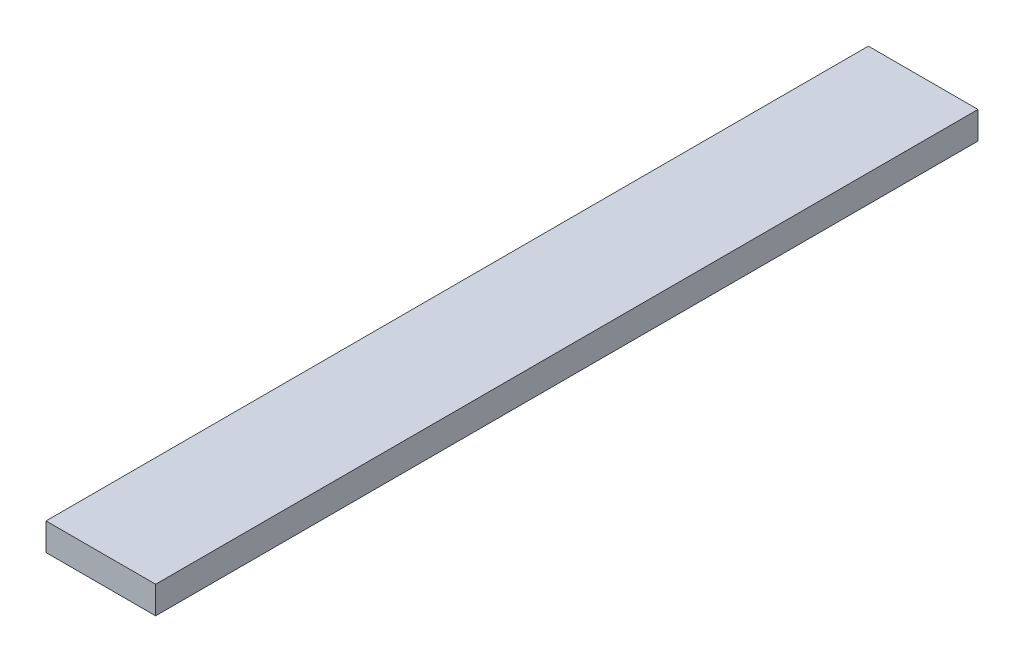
from build123d import *

# Parameters (mm, degrees)
SKETCH1_W           = 50.8
SKETCH1_H           = 12.7
BOSS_EXTRUDE1_DEPTH = 381


with BuildPart() as part:
    # Sketch1 → Boss-Extrude1 (new body)
    with BuildSketch(Plane.XY):
        Rectangle(SKETCH1_W, SKETCH1_H)
    extrude(amount=BOSS_EXTRUDE1_DEPTH)


solid = part.part
